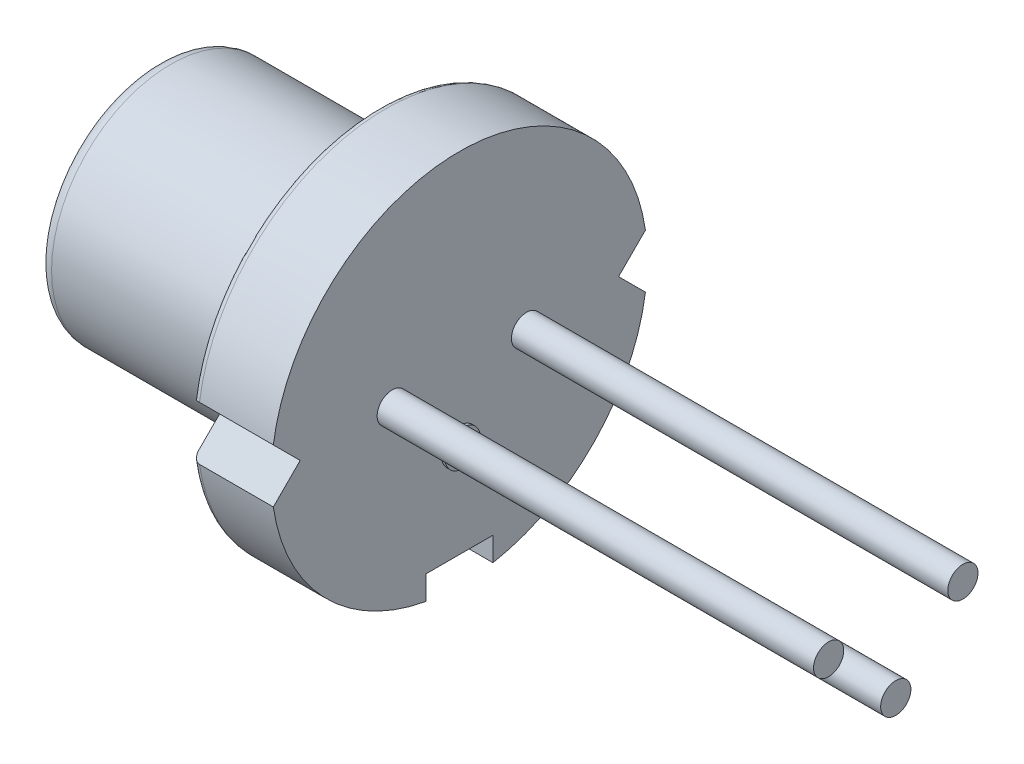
ISO-10303-21;
HEADER;
FILE_DESCRIPTION(('STEP AP214'),'2;1');
FILE_NAME('part.step','',(''),(''),'','','');
FILE_SCHEMA(('AUTOMOTIVE_DESIGN { 1 0 10303 214 1 1 1 1 }'));
ENDSEC;
DATA;
#1=APPLICATION_CONTEXT('core data for automotive mechanical design processes');
#2=APPLICATION_PROTOCOL_DEFINITION('international standard','automotive_design',2000,#1);
#3=PRODUCT_CONTEXT('',#1,'mechanical');
#4=PRODUCT('Part','Part','',(#3));
#5=PRODUCT_RELATED_PRODUCT_CATEGORY('part','',(#4));
#6=PRODUCT_DEFINITION_FORMATION('','',#4);
#7=PRODUCT_DEFINITION_CONTEXT('part definition',#1,'design');
#8=PRODUCT_DEFINITION('design','',#6,#7);
#9=PRODUCT_DEFINITION_SHAPE('','',#8);
#10=(LENGTH_UNIT() NAMED_UNIT(*) SI_UNIT(.MILLI.,.METRE.));
#11=(NAMED_UNIT(*) PLANE_ANGLE_UNIT() SI_UNIT($,.RADIAN.));
#12=(NAMED_UNIT(*) SI_UNIT($,.STERADIAN.) SOLID_ANGLE_UNIT());
#13=UNCERTAINTY_MEASURE_WITH_UNIT(LENGTH_MEASURE(1.E-05),#10,'distance_accuracy_value','');
#14=(GEOMETRIC_REPRESENTATION_CONTEXT(3) GLOBAL_UNCERTAINTY_ASSIGNED_CONTEXT((#13)) GLOBAL_UNIT_ASSIGNED_CONTEXT((#10,
#11,#12)) REPRESENTATION_CONTEXT('',''));
#15=CARTESIAN_POINT('',(0.,0.,0.));
#16=DIRECTION('',(0.,0.,1.));
#17=DIRECTION('',(1.,0.,0.));
#18=AXIS2_PLACEMENT_3D('',#15,#16,#17);
#19=CARTESIAN_POINT('',(3.47,0.,0.));
#20=DIRECTION('',(-1.,0.,0.));
#21=DIRECTION('',(0.,0.,1.));
#22=AXIS2_PLACEMENT_3D('',#19,#20,#21);
#23=PLANE('',#22);
#24=DIRECTION('',(0.,1.,0.));
#25=VECTOR('',#24,1.);
#26=CARTESIAN_POINT('',(3.47,0.,0.5));
#27=LINE('',#26,#25);
#28=CARTESIAN_POINT('',(3.47,-2.75499546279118,0.5));
#29=VERTEX_POINT('',#28);
#30=CARTESIAN_POINT('',(3.47,-2.4,0.5));
#31=VERTEX_POINT('',#30);
#32=EDGE_CURVE('E134',#29,#31,#27,.T.);
#33=ORIENTED_EDGE('',*,*,#32,.T.);
#34=DIRECTION('',(0.,0.,1.));
#35=VECTOR('',#34,1.);
#36=CARTESIAN_POINT('',(3.47,-2.4,0.));
#37=LINE('',#36,#35);
#38=CARTESIAN_POINT('',(3.47,-2.4,-0.5));
#39=VERTEX_POINT('',#38);
#40=EDGE_CURVE('E415',#39,#31,#37,.T.);
#41=ORIENTED_EDGE('',*,*,#40,.F.);
#42=DIRECTION('',(0.,1.,0.));
#43=VECTOR('',#42,1.);
#44=CARTESIAN_POINT('',(3.47,0.,-0.5));
#45=LINE('',#44,#43);
#46=CARTESIAN_POINT('',(3.47,-2.75499546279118,-0.5));
#47=VERTEX_POINT('',#46);
#48=EDGE_CURVE('E145',#47,#39,#45,.T.);
#49=ORIENTED_EDGE('',*,*,#48,.F.);
#50=CARTESIAN_POINT('',(3.47,0.,0.));
#51=DIRECTION('',(-1.,0.,0.));
#52=DIRECTION('',(0.,0.,1.));
#53=AXIS2_PLACEMENT_3D('',#50,#51,#52);
#54=CIRCLE('',#53,2.8);
#55=CARTESIAN_POINT('',(3.47,-0.4,-2.7712812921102));
#56=VERTEX_POINT('',#55);
#57=EDGE_CURVE('E163',#56,#47,#54,.T.);
#58=ORIENTED_EDGE('',*,*,#57,.F.);
#59=DIRECTION('',(0.,-0.707106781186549,-0.707106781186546));
#60=VECTOR('',#59,1.);
#61=CARTESIAN_POINT('',(3.47,1.1856406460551,-1.18564064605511));
#62=LINE('',#61,#60);
#63=CARTESIAN_POINT('',(3.47,0.,-2.3712812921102));
#64=VERTEX_POINT('',#63);
#65=EDGE_CURVE('E403',#64,#56,#62,.T.);
#66=ORIENTED_EDGE('',*,*,#65,.F.);
#67=DIRECTION('',(0.,0.707106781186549,-0.707106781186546));
#68=VECTOR('',#67,1.);
#69=CARTESIAN_POINT('',(3.47,-1.1856406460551,-1.18564064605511));
#70=LINE('',#69,#68);
#71=CARTESIAN_POINT('',(3.47,0.400000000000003,-2.7712812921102));
#72=VERTEX_POINT('',#71);
#73=EDGE_CURVE('E406',#64,#72,#70,.T.);
#74=ORIENTED_EDGE('',*,*,#73,.T.);
#75=CARTESIAN_POINT('',(3.47,0.400000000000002,2.7712812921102));
#76=VERTEX_POINT('',#75);
#77=EDGE_CURVE('E166',#76,#72,#54,.T.);
#78=ORIENTED_EDGE('',*,*,#77,.F.);
#79=DIRECTION('',(0.,0.707106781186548,0.707106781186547));
#80=VECTOR('',#79,1.);
#81=CARTESIAN_POINT('',(3.47,-1.1856406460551,1.1856406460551));
#82=LINE('',#81,#80);
#83=CARTESIAN_POINT('',(3.47,0.,2.3712812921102));
#84=VERTEX_POINT('',#83);
#85=EDGE_CURVE('E392',#84,#76,#82,.T.);
#86=ORIENTED_EDGE('',*,*,#85,.F.);
#87=DIRECTION('',(0.,-0.707106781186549,0.707106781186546));
#88=VECTOR('',#87,1.);
#89=CARTESIAN_POINT('',(3.47,1.1856406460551,1.18564064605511));
#90=LINE('',#89,#88);
#91=CARTESIAN_POINT('',(3.47,-0.400000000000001,2.7712812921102));
#92=VERTEX_POINT('',#91);
#93=EDGE_CURVE('E162',#84,#92,#90,.T.);
#94=ORIENTED_EDGE('',*,*,#93,.T.);
#95=EDGE_CURVE('E152',#29,#92,#54,.T.);
#96=ORIENTED_EDGE('',*,*,#95,.F.);
#97=EDGE_LOOP('',(#33,#41,#49,#58,#66,#74,#78,#86,#94,#96));
#98=FACE_BOUND('',#97,.T.);
#99=CARTESIAN_POINT('',(3.47,0.,1.));
#100=DIRECTION('',(-1.,0.,0.));
#101=DIRECTION('',(0.,0.,1.));
#102=AXIS2_PLACEMENT_3D('',#99,#100,#101);
#103=CIRCLE('',#102,0.225);
#104=CARTESIAN_POINT('',(3.47,0.,1.225));
#105=VERTEX_POINT('',#104);
#106=EDGE_CURVE('E188',#105,#105,#103,.F.);
#107=ORIENTED_EDGE('',*,*,#106,.F.);
#108=EDGE_LOOP('',(#107));
#109=FACE_BOUND('',#108,.T.);
#110=CARTESIAN_POINT('',(3.47,0.,-1.));
#111=DIRECTION('',(-1.,0.,0.));
#112=DIRECTION('',(0.,0.,1.));
#113=AXIS2_PLACEMENT_3D('',#110,#111,#112);
#114=CIRCLE('',#113,0.225);
#115=CARTESIAN_POINT('',(3.47,0.,-0.775));
#116=VERTEX_POINT('',#115);
#117=EDGE_CURVE('E191',#116,#116,#114,.F.);
#118=ORIENTED_EDGE('',*,*,#117,.F.);
#119=EDGE_LOOP('',(#118));
#120=FACE_BOUND('',#119,.T.);
#121=CARTESIAN_POINT('',(3.47,-1.,0.));
#122=DIRECTION('',(-1.,0.,0.));
#123=DIRECTION('',(0.,0.,1.));
#124=AXIS2_PLACEMENT_3D('',#121,#122,#123);
#125=CIRCLE('',#124,0.265);
#126=CARTESIAN_POINT('',(3.47,-1.,0.265));
#127=VERTEX_POINT('',#126);
#128=EDGE_CURVE('E11',#127,#127,#125,.F.);
#129=ORIENTED_EDGE('',*,*,#128,.F.);
#130=EDGE_LOOP('',(#129));
#131=FACE_BOUND('',#130,.T.);
#132=ADVANCED_FACE('F37',(#98,#109,#120,#131),#23,.F.);
#133=CARTESIAN_POINT('',(2.27,2.8,0.));
#134=DIRECTION('',(1.,0.,0.));
#135=DIRECTION('',(0.,0.,-1.));
#136=AXIS2_PLACEMENT_3D('',#133,#134,#135);
#137=PLANE('',#136);
#138=CARTESIAN_POINT('',(2.27,0.,0.));
#139=DIRECTION('',(-1.,0.,0.));
#140=DIRECTION('',(0.,0.,1.));
#141=AXIS2_PLACEMENT_3D('',#138,#139,#140);
#142=CIRCLE('',#141,2.05);
#143=CARTESIAN_POINT('',(2.27,0.,2.05));
#144=VERTEX_POINT('',#143);
#145=EDGE_CURVE('E173',#144,#144,#142,.T.);
#146=ORIENTED_EDGE('',*,*,#145,.F.);
#147=EDGE_LOOP('',(#146));
#148=FACE_BOUND('',#147,.T.);
#149=DIRECTION('',(0.,-0.707106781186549,-0.707106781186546));
#150=VECTOR('',#149,1.);
#151=CARTESIAN_POINT('',(2.27,2.58564064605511,0.214359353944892));
#152=LINE('',#151,#150);
#153=CARTESIAN_POINT('',(2.27,0.,-2.3712812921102));
#154=VERTEX_POINT('',#153);
#155=CARTESIAN_POINT('',(2.27,-0.310773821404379,-2.68205511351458));
#156=VERTEX_POINT('',#155);
#157=EDGE_CURVE('E398',#154,#156,#152,.T.);
#158=ORIENTED_EDGE('',*,*,#157,.T.);
#159=CARTESIAN_POINT('',(2.27,0.,0.));
#160=DIRECTION('',(1.,0.,0.));
#161=DIRECTION('',(0.,0.,-1.));
#162=AXIS2_PLACEMENT_3D('',#159,#160,#161);
#163=CIRCLE('',#162,2.7);
#164=CARTESIAN_POINT('',(2.27,-2.65329983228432,-0.5));
#165=VERTEX_POINT('',#164);
#166=EDGE_CURVE('E218',#156,#165,#163,.F.);
#167=ORIENTED_EDGE('',*,*,#166,.T.);
#168=DIRECTION('',(0.,1.,0.));
#169=VECTOR('',#168,1.);
#170=CARTESIAN_POINT('',(2.27,2.8,-0.5));
#171=LINE('',#170,#169);
#172=CARTESIAN_POINT('',(2.27,-2.4,-0.5));
#173=VERTEX_POINT('',#172);
#174=EDGE_CURVE('E411',#165,#173,#171,.T.);
#175=ORIENTED_EDGE('',*,*,#174,.T.);
#176=DIRECTION('',(0.,0.,1.));
#177=VECTOR('',#176,1.);
#178=CARTESIAN_POINT('',(2.27,-2.4,0.));
#179=LINE('',#178,#177);
#180=CARTESIAN_POINT('',(2.27,-2.4,0.5));
#181=VERTEX_POINT('',#180);
#182=EDGE_CURVE('E156',#173,#181,#179,.T.);
#183=ORIENTED_EDGE('',*,*,#182,.T.);
#184=DIRECTION('',(0.,1.,0.));
#185=VECTOR('',#184,1.);
#186=CARTESIAN_POINT('',(2.27,2.8,0.5));
#187=LINE('',#186,#185);
#188=CARTESIAN_POINT('',(2.27,-2.65329983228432,0.5));
#189=VERTEX_POINT('',#188);
#190=EDGE_CURVE('E409',#189,#181,#187,.T.);
#191=ORIENTED_EDGE('',*,*,#190,.F.);
#192=CARTESIAN_POINT('',(2.27,0.,0.));
#193=DIRECTION('',(1.,0.,0.));
#194=DIRECTION('',(0.,0.,-1.));
#195=AXIS2_PLACEMENT_3D('',#192,#193,#194);
#196=CIRCLE('',#195,2.7);
#197=CARTESIAN_POINT('',(2.27,-0.31077382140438,2.68205511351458));
#198=VERTEX_POINT('',#197);
#199=EDGE_CURVE('E215',#189,#198,#196,.F.);
#200=ORIENTED_EDGE('',*,*,#199,.T.);
#201=DIRECTION('',(0.,-0.707106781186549,0.707106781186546));
#202=VECTOR('',#201,1.);
#203=CARTESIAN_POINT('',(2.27,2.58564064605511,-0.214359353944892));
#204=LINE('',#203,#202);
#205=CARTESIAN_POINT('',(2.27,0.,2.3712812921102));
#206=VERTEX_POINT('',#205);
#207=EDGE_CURVE('E384',#206,#198,#204,.T.);
#208=ORIENTED_EDGE('',*,*,#207,.F.);
#209=DIRECTION('',(0.,0.707106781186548,0.707106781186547));
#210=VECTOR('',#209,1.);
#211=CARTESIAN_POINT('',(2.27,0.214359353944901,2.5856406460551));
#212=LINE('',#211,#210);
#213=CARTESIAN_POINT('',(2.27,0.310773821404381,2.68205511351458));
#214=VERTEX_POINT('',#213);
#215=EDGE_CURVE('E387',#206,#214,#212,.T.);
#216=ORIENTED_EDGE('',*,*,#215,.T.);
#217=CARTESIAN_POINT('',(2.27,0.,0.));
#218=DIRECTION('',(1.,0.,0.));
#219=DIRECTION('',(0.,0.,-1.));
#220=AXIS2_PLACEMENT_3D('',#217,#218,#219);
#221=CIRCLE('',#220,2.7);
#222=CARTESIAN_POINT('',(2.27,0.310773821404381,-2.68205511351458));
#223=VERTEX_POINT('',#222);
#224=EDGE_CURVE('E212',#214,#223,#221,.F.);
#225=ORIENTED_EDGE('',*,*,#224,.T.);
#226=DIRECTION('',(0.,0.707106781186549,-0.707106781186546));
#227=VECTOR('',#226,1.);
#228=CARTESIAN_POINT('',(2.27,0.214359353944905,-2.58564064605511));
#229=LINE('',#228,#227);
#230=EDGE_CURVE('E396',#154,#223,#229,.T.);
#231=ORIENTED_EDGE('',*,*,#230,.F.);
#232=EDGE_LOOP('',(#158,#167,#175,#183,#191,#200,#208,#216,#225,#231));
#233=FACE_BOUND('',#232,.T.);
#234=ADVANCED_FACE('F329',(#148,#233),#137,.F.);
#235=CARTESIAN_POINT('',(-2.49171245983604,0.,0.));
#236=DIRECTION('',(-1.,0.,0.));
#237=DIRECTION('',(0.,0.,1.));
#238=AXIS2_PLACEMENT_3D('',#235,#236,#237);
#239=CYLINDRICAL_SURFACE('',#238,2.8);
#240=DIRECTION('',(-1.,0.,0.));
#241=VECTOR('',#240,1.);
#242=CARTESIAN_POINT('',(-2.49171245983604,-0.400000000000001,2.7712812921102));
#243=LINE('',#242,#241);
#244=CARTESIAN_POINT('',(2.37,-0.400000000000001,2.7712812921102));
#245=VERTEX_POINT('',#244);
#246=EDGE_CURVE('E196',#245,#92,#243,.F.);
#247=ORIENTED_EDGE('',*,*,#246,.F.);
#248=CARTESIAN_POINT('',(2.37,0.,0.));
#249=DIRECTION('',(1.,0.,0.));
#250=DIRECTION('',(0.,0.,-1.));
#251=AXIS2_PLACEMENT_3D('',#248,#249,#250);
#252=CIRCLE('',#251,2.8);
#253=CARTESIAN_POINT('',(2.37,-2.75499546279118,0.5));
#254=VERTEX_POINT('',#253);
#255=EDGE_CURVE('E155',#245,#254,#252,.T.);
#256=ORIENTED_EDGE('',*,*,#255,.T.);
#257=DIRECTION('',(-1.,0.,0.));
#258=VECTOR('',#257,1.);
#259=CARTESIAN_POINT('',(-2.49171245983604,-2.75499546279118,0.5));
#260=LINE('',#259,#258);
#261=EDGE_CURVE('E137',#29,#254,#260,.T.);
#262=ORIENTED_EDGE('',*,*,#261,.F.);
#263=ORIENTED_EDGE('',*,*,#95,.T.);
#264=EDGE_LOOP('',(#247,#256,#262,#263));
#265=FACE_BOUND('',#264,.T.);
#266=ADVANCED_FACE('F151',(#265),#239,.T.);
#267=DIRECTION('',(-1.,0.,0.));
#268=VECTOR('',#267,1.);
#269=CARTESIAN_POINT('',(-2.49171245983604,0.400000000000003,-2.7712812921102));
#270=LINE('',#269,#268);
#271=CARTESIAN_POINT('',(2.37,0.400000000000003,-2.7712812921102));
#272=VERTEX_POINT('',#271);
#273=EDGE_CURVE('E200',#272,#72,#270,.F.);
#274=ORIENTED_EDGE('',*,*,#273,.F.);
#275=CARTESIAN_POINT('',(2.37,0.,0.));
#276=DIRECTION('',(1.,0.,0.));
#277=DIRECTION('',(0.,0.,-1.));
#278=AXIS2_PLACEMENT_3D('',#275,#276,#277);
#279=CIRCLE('',#278,2.8);
#280=CARTESIAN_POINT('',(2.37,0.400000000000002,2.7712812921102));
#281=VERTEX_POINT('',#280);
#282=EDGE_CURVE('E54',#272,#281,#279,.T.);
#283=ORIENTED_EDGE('',*,*,#282,.T.);
#284=DIRECTION('',(-1.,0.,0.));
#285=VECTOR('',#284,1.);
#286=CARTESIAN_POINT('',(-2.49171245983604,0.400000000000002,2.7712812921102));
#287=LINE('',#286,#285);
#288=EDGE_CURVE('E194',#281,#76,#287,.F.);
#289=ORIENTED_EDGE('',*,*,#288,.T.);
#290=ORIENTED_EDGE('',*,*,#77,.T.);
#291=EDGE_LOOP('',(#274,#283,#289,#290));
#292=FACE_BOUND('',#291,.T.);
#293=ADVANCED_FACE('F334',(#292),#239,.T.);
#294=DIRECTION('',(-1.,0.,0.));
#295=VECTOR('',#294,1.);
#296=CARTESIAN_POINT('',(-2.49171245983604,-2.75499546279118,-0.5));
#297=LINE('',#296,#295);
#298=CARTESIAN_POINT('',(2.37,-2.75499546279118,-0.5));
#299=VERTEX_POINT('',#298);
#300=EDGE_CURVE('E157',#47,#299,#297,.T.);
#301=ORIENTED_EDGE('',*,*,#300,.T.);
#302=CARTESIAN_POINT('',(2.37,0.,0.));
#303=DIRECTION('',(1.,0.,0.));
#304=DIRECTION('',(0.,0.,-1.));
#305=AXIS2_PLACEMENT_3D('',#302,#303,#304);
#306=CIRCLE('',#305,2.8);
#307=CARTESIAN_POINT('',(2.37,-0.4,-2.7712812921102));
#308=VERTEX_POINT('',#307);
#309=EDGE_CURVE('E229',#299,#308,#306,.T.);
#310=ORIENTED_EDGE('',*,*,#309,.T.);
#311=DIRECTION('',(-1.,0.,0.));
#312=VECTOR('',#311,1.);
#313=CARTESIAN_POINT('',(-2.49171245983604,-0.4,-2.7712812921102));
#314=LINE('',#313,#312);
#315=EDGE_CURVE('E198',#308,#56,#314,.F.);
#316=ORIENTED_EDGE('',*,*,#315,.T.);
#317=ORIENTED_EDGE('',*,*,#57,.T.);
#318=EDGE_LOOP('',(#301,#310,#316,#317));
#319=FACE_BOUND('',#318,.T.);
#320=ADVANCED_FACE('F330',(#319),#239,.T.);
#321=CARTESIAN_POINT('',(-1.03,0.8,0.));
#322=DIRECTION('',(1.,0.,0.));
#323=DIRECTION('',(0.,0.,-1.));
#324=AXIS2_PLACEMENT_3D('',#321,#322,#323);
#325=PLANE('',#324);
#326=CARTESIAN_POINT('',(-1.03,0.,0.));
#327=DIRECTION('',(1.,0.,0.));
#328=DIRECTION('',(0.,0.,-1.));
#329=AXIS2_PLACEMENT_3D('',#326,#327,#328);
#330=CIRCLE('',#329,1.575);
#331=CARTESIAN_POINT('',(-1.03,0.,-1.575));
#332=VERTEX_POINT('',#331);
#333=EDGE_CURVE('E206',#332,#332,#330,.F.);
#334=ORIENTED_EDGE('',*,*,#333,.T.);
#335=EDGE_LOOP('',(#334));
#336=FACE_BOUND('',#335,.T.);
#337=CARTESIAN_POINT('',(-1.03,0.,0.));
#338=DIRECTION('',(-1.,0.,0.));
#339=DIRECTION('',(0.,0.,1.));
#340=AXIS2_PLACEMENT_3D('',#337,#338,#339);
#341=CIRCLE('',#340,0.8);
#342=CARTESIAN_POINT('',(-1.03,0.,0.8));
#343=VERTEX_POINT('',#342);
#344=EDGE_CURVE('E169',#343,#343,#341,.T.);
#345=ORIENTED_EDGE('',*,*,#344,.F.);
#346=EDGE_LOOP('',(#345));
#347=FACE_BOUND('',#346,.T.);
#348=ADVANCED_FACE('F333',(#336,#347),#325,.F.);
#349=CARTESIAN_POINT('',(-2.49171245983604,0.,0.));
#350=DIRECTION('',(-1.,0.,0.));
#351=DIRECTION('',(0.,0.,1.));
#352=AXIS2_PLACEMENT_3D('',#349,#350,#351);
#353=CYLINDRICAL_SURFACE('',#352,1.775);
#354=CARTESIAN_POINT('',(-0.830000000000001,0.,0.));
#355=DIRECTION('',(1.,0.,0.));
#356=DIRECTION('',(0.,0.,-1.));
#357=AXIS2_PLACEMENT_3D('',#354,#355,#356);
#358=CIRCLE('',#357,1.775);
#359=CARTESIAN_POINT('',(-0.830000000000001,0.,-1.775));
#360=VERTEX_POINT('',#359);
#361=EDGE_CURVE('E209',#360,#360,#358,.T.);
#362=ORIENTED_EDGE('',*,*,#361,.T.);
#363=EDGE_LOOP('',(#362));
#364=FACE_BOUND('',#363,.T.);
#365=CARTESIAN_POINT('',(1.72,0.,0.));
#366=DIRECTION('',(-1.,0.,0.));
#367=DIRECTION('',(0.,0.,1.));
#368=AXIS2_PLACEMENT_3D('',#365,#366,#367);
#369=CIRCLE('',#368,1.775);
#370=CARTESIAN_POINT('',(1.72,0.,1.775));
#371=VERTEX_POINT('',#370);
#372=EDGE_CURVE('E185',#371,#371,#369,.T.);
#373=ORIENTED_EDGE('',*,*,#372,.T.);
#374=EDGE_LOOP('',(#373));
#375=FACE_BOUND('',#374,.T.);
#376=ADVANCED_FACE('F349',(#364,#375),#353,.T.);
#377=CARTESIAN_POINT('',(1.72,0.,0.));
#378=DIRECTION('',(-1.,0.,0.));
#379=DIRECTION('',(0.,0.,1.));
#380=AXIS2_PLACEMENT_3D('',#377,#378,#379);
#381=TOROIDAL_SURFACE('',#380,2.025,0.25);
#382=ORIENTED_EDGE('',*,*,#372,.F.);
#383=EDGE_LOOP('',(#382));
#384=FACE_BOUND('',#383,.T.);
#385=CARTESIAN_POINT('',(1.97,0.,0.));
#386=DIRECTION('',(-1.,0.,0.));
#387=DIRECTION('',(0.,0.,1.));
#388=AXIS2_PLACEMENT_3D('',#385,#386,#387);
#389=CIRCLE('',#388,2.025);
#390=CARTESIAN_POINT('',(1.97,0.,2.025));
#391=VERTEX_POINT('',#390);
#392=EDGE_CURVE('E180',#391,#391,#389,.T.);
#393=ORIENTED_EDGE('',*,*,#392,.T.);
#394=EDGE_LOOP('',(#393));
#395=FACE_BOUND('',#394,.T.);
#396=ADVANCED_FACE('F345',(#384,#395),#381,.F.);
#397=CARTESIAN_POINT('',(1.97,2.05,0.));
#398=DIRECTION('',(1.,0.,0.));
#399=DIRECTION('',(0.,0.,-1.));
#400=AXIS2_PLACEMENT_3D('',#397,#398,#399);
#401=PLANE('',#400);
#402=ORIENTED_EDGE('',*,*,#392,.F.);
#403=EDGE_LOOP('',(#402));
#404=FACE_BOUND('',#403,.T.);
#405=CARTESIAN_POINT('',(1.97,0.,0.));
#406=DIRECTION('',(-1.,0.,0.));
#407=DIRECTION('',(0.,0.,1.));
#408=AXIS2_PLACEMENT_3D('',#405,#406,#407);
#409=CIRCLE('',#408,2.05);
#410=CARTESIAN_POINT('',(1.97,0.,2.05));
#411=VERTEX_POINT('',#410);
#412=EDGE_CURVE('E176',#411,#411,#409,.T.);
#413=ORIENTED_EDGE('',*,*,#412,.T.);
#414=EDGE_LOOP('',(#413));
#415=FACE_BOUND('',#414,.T.);
#416=ADVANCED_FACE('F341',(#404,#415),#401,.F.);
#417=CARTESIAN_POINT('',(-2.49171245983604,0.,0.));
#418=DIRECTION('',(-1.,0.,0.));
#419=DIRECTION('',(0.,0.,1.));
#420=AXIS2_PLACEMENT_3D('',#417,#418,#419);
#421=CYLINDRICAL_SURFACE('',#420,2.05);
#422=ORIENTED_EDGE('',*,*,#412,.F.);
#423=EDGE_LOOP('',(#422));
#424=FACE_BOUND('',#423,.T.);
#425=ORIENTED_EDGE('',*,*,#145,.T.);
#426=EDGE_LOOP('',(#425));
#427=FACE_BOUND('',#426,.T.);
#428=ADVANCED_FACE('F315',(#424,#427),#421,.T.);
#429=CARTESIAN_POINT('',(-2.49171245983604,0.,0.));
#430=DIRECTION('',(-1.,0.,0.));
#431=DIRECTION('',(0.,0.,1.));
#432=AXIS2_PLACEMENT_3D('',#429,#430,#431);
#433=CYLINDRICAL_SURFACE('',#432,0.8);
#434=CARTESIAN_POINT('',(-0.980000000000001,0.,0.));
#435=DIRECTION('',(-1.,0.,0.));
#436=DIRECTION('',(0.,0.,1.));
#437=AXIS2_PLACEMENT_3D('',#434,#435,#436);
#438=CIRCLE('',#437,0.8);
#439=CARTESIAN_POINT('',(-0.980000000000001,0.,0.8));
#440=VERTEX_POINT('',#439);
#441=EDGE_CURVE('E422',#440,#440,#438,.T.);
#442=ORIENTED_EDGE('',*,*,#441,.F.);
#443=EDGE_LOOP('',(#442));
#444=FACE_BOUND('',#443,.T.);
#445=ORIENTED_EDGE('',*,*,#344,.T.);
#446=EDGE_LOOP('',(#445));
#447=FACE_BOUND('',#446,.T.);
#448=ADVANCED_FACE('F302',(#444,#447),#433,.F.);
#449=CARTESIAN_POINT('',(9.97,0.,1.));
#450=DIRECTION('',(-1.,0.,0.));
#451=DIRECTION('',(0.,0.,1.));
#452=AXIS2_PLACEMENT_3D('',#449,#450,#451);
#453=CYLINDRICAL_SURFACE('',#452,0.225);
#454=CARTESIAN_POINT('',(9.97,0.,1.));
#455=DIRECTION('',(1.,0.,0.));
#456=DIRECTION('',(0.,0.,-1.));
#457=AXIS2_PLACEMENT_3D('',#454,#455,#456);
#458=CIRCLE('',#457,0.225);
#459=CARTESIAN_POINT('',(9.97,0.,0.775));
#460=VERTEX_POINT('',#459);
#461=EDGE_CURVE('E376',#460,#460,#458,.T.);
#462=ORIENTED_EDGE('',*,*,#461,.F.);
#463=EDGE_LOOP('',(#462));
#464=FACE_BOUND('',#463,.T.);
#465=ORIENTED_EDGE('',*,*,#106,.T.);
#466=EDGE_LOOP('',(#465));
#467=FACE_BOUND('',#466,.T.);
#468=ADVANCED_FACE('F298',(#464,#467),#453,.T.);
#469=CARTESIAN_POINT('',(9.97,0.,0.));
#470=DIRECTION('',(1.,0.,0.));
#471=DIRECTION('',(0.,0.,-1.));
#472=AXIS2_PLACEMENT_3D('',#469,#470,#471);
#473=PLANE('',#472);
#474=ORIENTED_EDGE('',*,*,#461,.T.);
#475=EDGE_LOOP('',(#474));
#476=FACE_BOUND('',#475,.T.);
#477=ADVANCED_FACE('F294',(#476),#473,.T.);
#478=CARTESIAN_POINT('',(9.97,0.,-1.));
#479=DIRECTION('',(-1.,0.,0.));
#480=DIRECTION('',(0.,0.,1.));
#481=AXIS2_PLACEMENT_3D('',#478,#479,#480);
#482=CYLINDRICAL_SURFACE('',#481,0.225);
#483=CARTESIAN_POINT('',(9.97,0.,-1.));
#484=DIRECTION('',(1.,0.,0.));
#485=DIRECTION('',(0.,0.,-1.));
#486=AXIS2_PLACEMENT_3D('',#483,#484,#485);
#487=CIRCLE('',#486,0.225);
#488=CARTESIAN_POINT('',(9.97,0.,-1.225));
#489=VERTEX_POINT('',#488);
#490=EDGE_CURVE('E381',#489,#489,#487,.T.);
#491=ORIENTED_EDGE('',*,*,#490,.F.);
#492=EDGE_LOOP('',(#491));
#493=FACE_BOUND('',#492,.T.);
#494=ORIENTED_EDGE('',*,*,#117,.T.);
#495=EDGE_LOOP('',(#494));
#496=FACE_BOUND('',#495,.T.);
#497=ADVANCED_FACE('F290',(#493,#496),#482,.T.);
#498=CARTESIAN_POINT('',(9.97,0.,0.));
#499=DIRECTION('',(1.,0.,0.));
#500=DIRECTION('',(0.,0.,-1.));
#501=AXIS2_PLACEMENT_3D('',#498,#499,#500);
#502=PLANE('',#501);
#503=ORIENTED_EDGE('',*,*,#490,.T.);
#504=EDGE_LOOP('',(#503));
#505=FACE_BOUND('',#504,.T.);
#506=ADVANCED_FACE('F285',(#505),#502,.T.);
#507=CARTESIAN_POINT('',(-1.03,1.1856406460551,1.18564064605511));
#508=DIRECTION('',(0.,0.707106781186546,0.707106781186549));
#509=DIRECTION('',(0.,-0.707106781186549,0.707106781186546));
#510=AXIS2_PLACEMENT_3D('',#507,#508,#509);
#511=PLANE('',#510);
#512=ORIENTED_EDGE('',*,*,#207,.T.);
#513=CARTESIAN_POINT('',(2.27,-0.310773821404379,2.68205511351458));
#514=CARTESIAN_POINT('',(2.27000279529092,-0.316742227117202,2.6880235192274));
#515=CARTESIAN_POINT('',(2.27065738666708,-0.322722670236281,2.69400396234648));
#516=CARTESIAN_POINT('',(2.27332459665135,-0.334568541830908,2.70584983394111));
#517=CARTESIAN_POINT('',(2.27534602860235,-0.340432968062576,2.71171426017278));
#518=CARTESIAN_POINT('',(2.28037417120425,-0.350930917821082,2.72221220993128));
#519=CARTESIAN_POINT('',(2.28317632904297,-0.355613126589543,2.72689441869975));
#520=CARTESIAN_POINT('',(2.28981350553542,-0.364588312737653,2.73586960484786));
#521=CARTESIAN_POINT('',(2.29364577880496,-0.368882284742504,2.74016357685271));
#522=CARTESIAN_POINT('',(2.30150308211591,-0.376125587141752,2.74740687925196));
#523=CARTESIAN_POINT('',(2.30534526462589,-0.379173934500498,2.7504552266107));
#524=CARTESIAN_POINT('',(2.31368423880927,-0.384788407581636,2.75606969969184));
#525=CARTESIAN_POINT('',(2.318180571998,-0.387354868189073,2.75863616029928));
#526=CARTESIAN_POINT('',(2.32704364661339,-0.391535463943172,2.76281675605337));
#527=CARTESIAN_POINT('',(2.33133020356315,-0.39323446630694,2.76451575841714));
#528=CARTESIAN_POINT('',(2.34024204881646,-0.396102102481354,2.76738339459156));
#529=CARTESIAN_POINT('',(2.34486677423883,-0.397271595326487,2.76855288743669));
#530=CARTESIAN_POINT('',(2.35292395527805,-0.398754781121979,2.77003607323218));
#531=CARTESIAN_POINT('',(2.35630190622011,-0.399219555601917,2.77050084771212));
#532=CARTESIAN_POINT('',(2.36311894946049,-0.399843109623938,2.77112440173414));
#533=CARTESIAN_POINT('',(2.36655812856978,-0.400001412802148,2.77128270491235));
#534=CARTESIAN_POINT('',(2.36999999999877,-0.400000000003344,2.77128129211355));
#535=B_SPLINE_CURVE_WITH_KNOTS('',3,(#513,#514,#515,#516,#517,#518,#519,#520,#521,#522,#523,
#524,#525,#526,#527,#528,#529,#530,#531,#532,#533,#534),.UNSPECIFIED.,.F.,.F.,(4,2,2,2,2,2,2,2,
2,2,4),(0.,0.0253253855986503,0.0508156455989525,0.0723033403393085,0.0937343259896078,
0.110992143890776,0.128237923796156,0.142918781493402,0.157575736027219,0.167873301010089,
0.178186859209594),.UNSPECIFIED.);
#536=EDGE_CURVE('E268',#198,#245,#535,.T.);
#537=ORIENTED_EDGE('',*,*,#536,.T.);
#538=ORIENTED_EDGE('',*,*,#246,.T.);
#539=ORIENTED_EDGE('',*,*,#93,.F.);
#540=DIRECTION('',(1.,0.,0.));
#541=VECTOR('',#540,1.);
#542=CARTESIAN_POINT('',(-1.03,0.,2.3712812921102));
#543=LINE('',#542,#541);
#544=EDGE_CURVE('E390',#206,#84,#543,.T.);
#545=ORIENTED_EDGE('',*,*,#544,.F.);
#546=EDGE_LOOP('',(#512,#537,#538,#539,#545));
#547=FACE_BOUND('',#546,.T.);
#548=ADVANCED_FACE('F279',(#547),#511,.T.);
#549=CARTESIAN_POINT('',(-1.03,-1.1856406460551,1.1856406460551));
#550=DIRECTION('',(0.,0.707106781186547,-0.707106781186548));
#551=DIRECTION('',(0.,0.707106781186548,0.707106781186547));
#552=AXIS2_PLACEMENT_3D('',#549,#550,#551);
#553=PLANE('',#552);
#554=ORIENTED_EDGE('',*,*,#288,.F.);
#555=CARTESIAN_POINT('',(2.37,0.400000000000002,2.7712812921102));
#556=CARTESIAN_POINT('',(2.36517210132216,0.400006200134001,2.7712874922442));
#557=CARTESIAN_POINT('',(2.36035184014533,0.399691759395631,2.77097305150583));
#558=CARTESIAN_POINT('',(2.35089061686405,0.398473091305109,2.76975438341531));
#559=CARTESIAN_POINT('',(2.34624877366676,0.397572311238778,2.76885360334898));
#560=CARTESIAN_POINT('',(2.33725565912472,0.395233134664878,2.76651442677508));
#561=CARTESIAN_POINT('',(2.33290396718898,0.393795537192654,2.76507682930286));
#562=CARTESIAN_POINT('',(2.32456944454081,0.390456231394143,2.76173752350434));
#563=CARTESIAN_POINT('',(2.32058708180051,0.388553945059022,2.75983523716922));
#564=CARTESIAN_POINT('',(2.31279627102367,0.384221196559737,2.75550248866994));
#565=CARTESIAN_POINT('',(2.30901824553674,0.381763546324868,2.75304483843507));
#566=CARTESIAN_POINT('',(2.30198781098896,0.376499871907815,2.74778116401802));
#567=CARTESIAN_POINT('',(2.29873554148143,0.373693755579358,2.74497504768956));
#568=CARTESIAN_POINT('',(2.29220147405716,0.367255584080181,2.73853687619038));
#569=CARTESIAN_POINT('',(2.28903004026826,0.363567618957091,2.73484891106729));
#570=CARTESIAN_POINT('',(2.28343330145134,0.35591791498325,2.72719920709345));
#571=CARTESIAN_POINT('',(2.28100876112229,0.351955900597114,2.72323719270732));
#572=CARTESIAN_POINT('',(2.27645876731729,0.343000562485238,2.71428185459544));
#573=CARTESIAN_POINT('',(2.27450134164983,0.337964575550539,2.70924586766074));
#574=CARTESIAN_POINT('',(2.27161901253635,0.327753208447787,2.69903450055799));
#575=CARTESIAN_POINT('',(2.2706931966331,0.322577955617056,2.69385924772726));
#576=CARTESIAN_POINT('',(2.27008961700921,0.315183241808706,2.68646453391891));
#577=CARTESIAN_POINT('',(2.27000015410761,0.312978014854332,2.68425930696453));
#578=CARTESIAN_POINT('',(2.27,0.310773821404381,2.68205511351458));
#579=B_SPLINE_CURVE_WITH_KNOTS('',3,(#555,#556,#557,#558,#559,#560,#561,#562,#563,#564,#565,
#566,#567,#568,#569,#570,#571,#572,#573,#574,#575,#576,#577,#578),.UNSPECIFIED.,.F.,.F.,(4,2,2,
2,2,2,2,2,2,2,2,4),(0.,0.0144512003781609,0.0288181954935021,0.0431638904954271,
0.0575275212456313,0.0728715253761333,0.0882195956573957,0.106465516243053,0.124730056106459,
0.146806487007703,0.16886337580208,0.178217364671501),.UNSPECIFIED.);
#580=EDGE_CURVE('E47',#281,#214,#579,.T.);
#581=ORIENTED_EDGE('',*,*,#580,.T.);
#582=ORIENTED_EDGE('',*,*,#215,.F.);
#583=ORIENTED_EDGE('',*,*,#544,.T.);
#584=ORIENTED_EDGE('',*,*,#85,.T.);
#585=EDGE_LOOP('',(#554,#581,#582,#583,#584));
#586=FACE_BOUND('',#585,.T.);
#587=ADVANCED_FACE('F284',(#586),#553,.F.);
#588=CARTESIAN_POINT('',(-1.03,-1.1856406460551,-1.18564064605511));
#589=DIRECTION('',(0.,-0.707106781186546,-0.707106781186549));
#590=DIRECTION('',(0.,0.707106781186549,-0.707106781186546));
#591=AXIS2_PLACEMENT_3D('',#588,#589,#590);
#592=PLANE('',#591);
#593=ORIENTED_EDGE('',*,*,#230,.T.);
#594=CARTESIAN_POINT('',(2.27,0.310773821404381,-2.68205511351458));
#595=CARTESIAN_POINT('',(2.27000279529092,0.316742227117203,-2.6880235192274));
#596=CARTESIAN_POINT('',(2.27065738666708,0.322722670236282,-2.69400396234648));
#597=CARTESIAN_POINT('',(2.27332459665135,0.334568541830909,-2.70584983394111));
#598=CARTESIAN_POINT('',(2.27534602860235,0.340432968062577,-2.71171426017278));
#599=CARTESIAN_POINT('',(2.28037417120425,0.350930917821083,-2.72221220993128));
#600=CARTESIAN_POINT('',(2.28317632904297,0.355613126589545,-2.72689441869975));
#601=CARTESIAN_POINT('',(2.28981350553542,0.364588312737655,-2.73586960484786));
#602=CARTESIAN_POINT('',(2.29364577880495,0.368882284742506,-2.74016357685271));
#603=CARTESIAN_POINT('',(2.30150308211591,0.376125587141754,-2.74740687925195));
#604=CARTESIAN_POINT('',(2.30534526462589,0.379173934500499,-2.7504552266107));
#605=CARTESIAN_POINT('',(2.31368423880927,0.384788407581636,-2.75606969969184));
#606=CARTESIAN_POINT('',(2.318180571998,0.387354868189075,-2.75863616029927));
#607=CARTESIAN_POINT('',(2.32704364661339,0.391535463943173,-2.76281675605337));
#608=CARTESIAN_POINT('',(2.33133020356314,0.393234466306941,-2.76451575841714));
#609=CARTESIAN_POINT('',(2.34024204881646,0.396102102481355,-2.76738339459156));
#610=CARTESIAN_POINT('',(2.34486677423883,0.397271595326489,-2.76855288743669));
#611=CARTESIAN_POINT('',(2.35292395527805,0.398754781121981,-2.77003607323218));
#612=CARTESIAN_POINT('',(2.35630190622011,0.399219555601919,-2.77050084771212));
#613=CARTESIAN_POINT('',(2.36311894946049,0.39984310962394,-2.77112440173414));
#614=CARTESIAN_POINT('',(2.36655812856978,0.40000141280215,-2.77128270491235));
#615=CARTESIAN_POINT('',(2.36999999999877,0.400000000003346,-2.77128129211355));
#616=B_SPLINE_CURVE_WITH_KNOTS('',3,(#594,#595,#596,#597,#598,#599,#600,#601,#602,#603,#604,
#605,#606,#607,#608,#609,#610,#611,#612,#613,#614,#615),.UNSPECIFIED.,.F.,.F.,(4,2,2,2,2,2,2,2,
2,2,4),(0.,0.02532538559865,0.0508156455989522,0.0723033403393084,0.0937343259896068,
0.110992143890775,0.128237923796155,0.142918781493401,0.157575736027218,0.167873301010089,
0.178186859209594),.UNSPECIFIED.);
#617=EDGE_CURVE('E62',#223,#272,#616,.T.);
#618=ORIENTED_EDGE('',*,*,#617,.T.);
#619=ORIENTED_EDGE('',*,*,#273,.T.);
#620=ORIENTED_EDGE('',*,*,#73,.F.);
#621=DIRECTION('',(1.,0.,0.));
#622=VECTOR('',#621,1.);
#623=CARTESIAN_POINT('',(-1.03,0.,-2.3712812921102));
#624=LINE('',#623,#622);
#625=EDGE_CURVE('E401',#154,#64,#624,.T.);
#626=ORIENTED_EDGE('',*,*,#625,.F.);
#627=EDGE_LOOP('',(#593,#618,#619,#620,#626));
#628=FACE_BOUND('',#627,.T.);
#629=ADVANCED_FACE('F535',(#628),#592,.T.);
#630=CARTESIAN_POINT('',(-1.03,1.1856406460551,-1.18564064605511));
#631=DIRECTION('',(0.,-0.707106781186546,0.707106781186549));
#632=DIRECTION('',(0.,-0.707106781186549,-0.707106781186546));
#633=AXIS2_PLACEMENT_3D('',#630,#631,#632);
#634=PLANE('',#633);
#635=ORIENTED_EDGE('',*,*,#315,.F.);
#636=CARTESIAN_POINT('',(2.37,-0.4,-2.7712812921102));
#637=CARTESIAN_POINT('',(2.36517210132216,-0.400006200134,-2.7712874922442));
#638=CARTESIAN_POINT('',(2.36035184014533,-0.39969175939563,-2.77097305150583));
#639=CARTESIAN_POINT('',(2.35089061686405,-0.398473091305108,-2.76975438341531));
#640=CARTESIAN_POINT('',(2.34624877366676,-0.397572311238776,-2.76885360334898));
#641=CARTESIAN_POINT('',(2.33725565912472,-0.395233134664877,-2.76651442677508));
#642=CARTESIAN_POINT('',(2.33290396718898,-0.393795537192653,-2.76507682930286));
#643=CARTESIAN_POINT('',(2.32456944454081,-0.390456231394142,-2.76173752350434));
#644=CARTESIAN_POINT('',(2.32058708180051,-0.388553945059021,-2.75983523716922));
#645=CARTESIAN_POINT('',(2.31279627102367,-0.384221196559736,-2.75550248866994));
#646=CARTESIAN_POINT('',(2.30901824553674,-0.381763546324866,-2.75304483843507));
#647=CARTESIAN_POINT('',(2.30198781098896,-0.376499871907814,-2.74778116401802));
#648=CARTESIAN_POINT('',(2.29873554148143,-0.373693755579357,-2.74497504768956));
#649=CARTESIAN_POINT('',(2.29220147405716,-0.367255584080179,-2.73853687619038));
#650=CARTESIAN_POINT('',(2.28903004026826,-0.36356761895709,-2.73484891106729));
#651=CARTESIAN_POINT('',(2.28343330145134,-0.355917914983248,-2.72719920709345));
#652=CARTESIAN_POINT('',(2.28100876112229,-0.351955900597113,-2.72323719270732));
#653=CARTESIAN_POINT('',(2.27645876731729,-0.343000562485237,-2.71428185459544));
#654=CARTESIAN_POINT('',(2.27450134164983,-0.337964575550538,-2.70924586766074));
#655=CARTESIAN_POINT('',(2.27161901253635,-0.327753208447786,-2.69903450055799));
#656=CARTESIAN_POINT('',(2.2706931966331,-0.322577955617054,-2.69385924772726));
#657=CARTESIAN_POINT('',(2.27008961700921,-0.315183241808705,-2.68646453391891));
#658=CARTESIAN_POINT('',(2.27000015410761,-0.31297801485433,-2.68425930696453));
#659=CARTESIAN_POINT('',(2.27,-0.310773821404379,-2.68205511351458));
#660=B_SPLINE_CURVE_WITH_KNOTS('',3,(#636,#637,#638,#639,#640,#641,#642,#643,#644,#645,#646,
#647,#648,#649,#650,#651,#652,#653,#654,#655,#656,#657,#658,#659),.UNSPECIFIED.,.F.,.F.,(4,2,2,
2,2,2,2,2,2,2,2,4),(0.,0.0144512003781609,0.0288181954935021,0.043163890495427,
0.057527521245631,0.0728715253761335,0.088219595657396,0.106465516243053,0.124730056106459,
0.146806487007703,0.16886337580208,0.178217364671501),.UNSPECIFIED.);
#661=EDGE_CURVE('E274',#308,#156,#660,.T.);
#662=ORIENTED_EDGE('',*,*,#661,.T.);
#663=ORIENTED_EDGE('',*,*,#157,.F.);
#664=ORIENTED_EDGE('',*,*,#625,.T.);
#665=ORIENTED_EDGE('',*,*,#65,.T.);
#666=EDGE_LOOP('',(#635,#662,#663,#664,#665));
#667=FACE_BOUND('',#666,.T.);
#668=ADVANCED_FACE('F246',(#667),#634,.F.);
#669=CARTESIAN_POINT('',(-1.03,-2.4,0.));
#670=DIRECTION('',(0.,1.,0.));
#671=DIRECTION('',(0.,0.,1.));
#672=AXIS2_PLACEMENT_3D('',#669,#670,#671);
#673=PLANE('',#672);
#674=DIRECTION('',(1.,0.,0.));
#675=VECTOR('',#674,1.);
#676=CARTESIAN_POINT('',(-1.03,-2.4,-0.5));
#677=LINE('',#676,#675);
#678=EDGE_CURVE('E413',#173,#39,#677,.T.);
#679=ORIENTED_EDGE('',*,*,#678,.T.);
#680=ORIENTED_EDGE('',*,*,#40,.T.);
#681=DIRECTION('',(1.,0.,0.));
#682=VECTOR('',#681,1.);
#683=CARTESIAN_POINT('',(-1.03,-2.4,0.5));
#684=LINE('',#683,#682);
#685=EDGE_CURVE('E140',#181,#31,#684,.T.);
#686=ORIENTED_EDGE('',*,*,#685,.F.);
#687=ORIENTED_EDGE('',*,*,#182,.F.);
#688=EDGE_LOOP('',(#679,#680,#686,#687));
#689=FACE_BOUND('',#688,.T.);
#690=ADVANCED_FACE('F241',(#689),#673,.F.);
#691=CARTESIAN_POINT('',(-1.03,0.,0.5));
#692=DIRECTION('',(0.,0.,-1.));
#693=DIRECTION('',(-1.,0.,0.));
#694=AXIS2_PLACEMENT_3D('',#691,#692,#693);
#695=PLANE('',#694);
#696=ORIENTED_EDGE('',*,*,#261,.T.);
#697=CARTESIAN_POINT('',(2.37,-2.75499546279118,0.5));
#698=CARTESIAN_POINT('',(2.36444028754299,-2.75500060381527,0.5));
#699=CARTESIAN_POINT('',(2.35888252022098,-2.75452455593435,0.5));
#700=CARTESIAN_POINT('',(2.34793188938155,-2.75264863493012,0.5));
#701=CARTESIAN_POINT('',(2.34253883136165,-2.75124989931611,0.5));
#702=CARTESIAN_POINT('',(2.33206247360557,-2.74756637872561,0.5));
#703=CARTESIAN_POINT('',(2.32697927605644,-2.74528130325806,0.5));
#704=CARTESIAN_POINT('',(2.31726542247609,-2.73989640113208,0.5));
#705=CARTESIAN_POINT('',(2.31263474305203,-2.73679661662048,0.5));
#706=CARTESIAN_POINT('',(2.30392062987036,-2.72984987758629,0.5));
#707=CARTESIAN_POINT('',(2.29984116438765,-2.72599794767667,0.5));
#708=CARTESIAN_POINT('',(2.29237430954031,-2.71767239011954,0.5));
#709=CARTESIAN_POINT('',(2.28898707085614,-2.71319862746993,0.5));
#710=CARTESIAN_POINT('',(2.28294572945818,-2.70368387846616,0.5));
#711=CARTESIAN_POINT('',(2.28030375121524,-2.69863520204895,0.5));
#712=CARTESIAN_POINT('',(2.27589115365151,-2.68817124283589,0.5));
#713=CARTESIAN_POINT('',(2.27412023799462,-2.68275608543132,0.5));
#714=CARTESIAN_POINT('',(2.27187371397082,-2.6733151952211,0.5));
#715=CARTESIAN_POINT('',(2.27117142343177,-2.66934179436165,0.5));
#716=CARTESIAN_POINT('',(2.27023458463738,-2.66134599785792,0.5));
#717=CARTESIAN_POINT('',(2.26999936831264,-2.65732368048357,0.5));
#718=CARTESIAN_POINT('',(2.26999999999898,-2.65329983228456,0.5));
#719=B_SPLINE_CURVE_WITH_KNOTS('',3,(#697,#698,#699,#700,#701,#702,#703,#704,#705,#706,#707,
#708,#709,#710,#711,#712,#713,#714,#715,#716,#717,#718),.UNSPECIFIED.,.F.,.F.,(4,2,2,2,2,2,2,2,
2,2,4),(0.,0.0166559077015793,0.0332913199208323,0.0499321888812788,0.0665721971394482,
0.0833262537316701,0.100083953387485,0.117100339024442,0.134110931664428,0.14618990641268,
0.158251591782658),.UNSPECIFIED.);
#720=EDGE_CURVE('E250',#254,#189,#719,.T.);
#721=ORIENTED_EDGE('',*,*,#720,.T.);
#722=ORIENTED_EDGE('',*,*,#190,.T.);
#723=ORIENTED_EDGE('',*,*,#685,.T.);
#724=ORIENTED_EDGE('',*,*,#32,.F.);
#725=EDGE_LOOP('',(#696,#721,#722,#723,#724));
#726=FACE_BOUND('',#725,.T.);
#727=ADVANCED_FACE('F136',(#726),#695,.T.);
#728=CARTESIAN_POINT('',(-1.03,0.,-0.5));
#729=DIRECTION('',(0.,0.,-1.));
#730=DIRECTION('',(-1.,0.,0.));
#731=AXIS2_PLACEMENT_3D('',#728,#729,#730);
#732=PLANE('',#731);
#733=ORIENTED_EDGE('',*,*,#174,.F.);
#734=CARTESIAN_POINT('',(2.27,-2.65329983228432,-0.5));
#735=CARTESIAN_POINT('',(2.26999553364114,-2.65909389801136,-0.5));
#736=CARTESIAN_POINT('',(2.27048605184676,-2.66488721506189,-0.5));
#737=CARTESIAN_POINT('',(2.27242559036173,-2.67630971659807,-0.5));
#738=CARTESIAN_POINT('',(2.27387436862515,-2.68193894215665,-0.5));
#739=CARTESIAN_POINT('',(2.27770028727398,-2.69287742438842,-0.5));
#740=CARTESIAN_POINT('',(2.28007805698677,-2.69818646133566,-0.5));
#741=CARTESIAN_POINT('',(2.28569769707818,-2.70832376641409,-0.5));
#742=CARTESIAN_POINT('',(2.28893928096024,-2.71315219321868,-0.5));
#743=CARTESIAN_POINT('',(2.29616844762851,-2.72214635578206,-0.5));
#744=CARTESIAN_POINT('',(2.30014943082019,-2.72631739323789,-0.5));
#745=CARTESIAN_POINT('',(2.30876644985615,-2.73391954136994,-0.5));
#746=CARTESIAN_POINT('',(2.31340259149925,-2.7373505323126,-0.5));
#747=CARTESIAN_POINT('',(2.32311782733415,-2.74331560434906,-0.5));
#748=CARTESIAN_POINT('',(2.32818872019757,-2.74586306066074,-0.5));
#749=CARTESIAN_POINT('',(2.33868905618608,-2.75005464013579,-0.5));
#750=CARTESIAN_POINT('',(2.34411820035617,-2.75169950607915,-0.5));
#751=CARTESIAN_POINT('',(2.3529906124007,-2.75357484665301,-0.5));
#752=CARTESIAN_POINT('',(2.35637293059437,-2.7541072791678,-0.5));
#753=CARTESIAN_POINT('',(2.36316963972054,-2.75481748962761,-0.5));
#754=CARTESIAN_POINT('',(2.36658397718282,-2.75499577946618,-0.5));
#755=CARTESIAN_POINT('',(2.36999999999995,-2.7549954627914,-0.5));
#756=B_SPLINE_CURVE_WITH_KNOTS('',3,(#734,#735,#736,#737,#738,#739,#740,#741,#742,#743,#744,
#745,#746,#747,#748,#749,#750,#751,#752,#753,#754,#755),.UNSPECIFIED.,.F.,.F.,(4,2,2,2,2,2,2,2,
2,2,4),(0.,0.0173605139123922,0.0347166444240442,0.0520845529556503,0.069446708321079,
0.0866607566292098,0.103877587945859,0.120821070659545,0.137750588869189,0.1480055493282,
0.158245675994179),.UNSPECIFIED.);
#757=EDGE_CURVE('E221',#165,#299,#756,.T.);
#758=ORIENTED_EDGE('',*,*,#757,.T.);
#759=ORIENTED_EDGE('',*,*,#300,.F.);
#760=ORIENTED_EDGE('',*,*,#48,.T.);
#761=ORIENTED_EDGE('',*,*,#678,.F.);
#762=EDGE_LOOP('',(#733,#758,#759,#760,#761));
#763=FACE_BOUND('',#762,.T.);
#764=ADVANCED_FACE('F234',(#763),#732,.F.);
#765=CARTESIAN_POINT('',(-0.980000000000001,0.,0.));
#766=DIRECTION('',(-1.,0.,0.));
#767=DIRECTION('',(0.,0.,1.));
#768=AXIS2_PLACEMENT_3D('',#765,#766,#767);
#769=PLANE('',#768);
#770=ORIENTED_EDGE('',*,*,#441,.T.);
#771=EDGE_LOOP('',(#770));
#772=FACE_BOUND('',#771,.T.);
#773=ADVANCED_FACE('F239',(#772),#769,.T.);
#774=CARTESIAN_POINT('',(-0.830000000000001,0.,0.));
#775=DIRECTION('',(1.,0.,0.));
#776=DIRECTION('',(0.,0.,-1.));
#777=AXIS2_PLACEMENT_3D('',#774,#775,#776);
#778=TOROIDAL_SURFACE('',#777,1.575,0.2);
#779=ORIENTED_EDGE('',*,*,#361,.F.);
#780=EDGE_LOOP('',(#779));
#781=FACE_BOUND('',#780,.T.);
#782=ORIENTED_EDGE('',*,*,#333,.F.);
#783=EDGE_LOOP('',(#782));
#784=FACE_BOUND('',#783,.T.);
#785=ADVANCED_FACE('F356',(#781,#784),#778,.T.);
#786=CARTESIAN_POINT('',(2.37,0.,0.));
#787=DIRECTION('',(1.,0.,0.));
#788=DIRECTION('',(0.,0.,-1.));
#789=AXIS2_PLACEMENT_3D('',#786,#787,#788);
#790=TOROIDAL_SURFACE('',#789,2.7,0.1);
#791=ORIENTED_EDGE('',*,*,#661,.F.);
#792=ORIENTED_EDGE('',*,*,#309,.F.);
#793=ORIENTED_EDGE('',*,*,#757,.F.);
#794=ORIENTED_EDGE('',*,*,#166,.F.);
#795=EDGE_LOOP('',(#791,#792,#793,#794));
#796=FACE_BOUND('',#795,.T.);
#797=ADVANCED_FACE('F231',(#796),#790,.T.);
#798=CARTESIAN_POINT('',(2.37,0.,0.));
#799=DIRECTION('',(1.,0.,0.));
#800=DIRECTION('',(0.,0.,-1.));
#801=AXIS2_PLACEMENT_3D('',#798,#799,#800);
#802=TOROIDAL_SURFACE('',#801,2.7,0.1);
#803=ORIENTED_EDGE('',*,*,#720,.F.);
#804=ORIENTED_EDGE('',*,*,#255,.F.);
#805=ORIENTED_EDGE('',*,*,#536,.F.);
#806=ORIENTED_EDGE('',*,*,#199,.F.);
#807=EDGE_LOOP('',(#803,#804,#805,#806));
#808=FACE_BOUND('',#807,.T.);
#809=ADVANCED_FACE('F263',(#808),#802,.T.);
#810=CARTESIAN_POINT('',(2.37,0.,0.));
#811=DIRECTION('',(1.,0.,0.));
#812=DIRECTION('',(0.,0.,-1.));
#813=AXIS2_PLACEMENT_3D('',#810,#811,#812);
#814=TOROIDAL_SURFACE('',#813,2.7,0.1);
#815=ORIENTED_EDGE('',*,*,#580,.F.);
#816=ORIENTED_EDGE('',*,*,#282,.F.);
#817=ORIENTED_EDGE('',*,*,#617,.F.);
#818=ORIENTED_EDGE('',*,*,#224,.F.);
#819=EDGE_LOOP('',(#815,#816,#817,#818));
#820=FACE_BOUND('',#819,.T.);
#821=ADVANCED_FACE('F39',(#820),#814,.T.);
#822=CARTESIAN_POINT('',(3.52,-1.,0.));
#823=DIRECTION('',(-1.,0.,0.));
#824=DIRECTION('',(0.,0.,1.));
#825=AXIS2_PLACEMENT_3D('',#822,#823,#824);
#826=CYLINDRICAL_SURFACE('',#825,0.265);
#827=CARTESIAN_POINT('',(3.52,-1.,0.));
#828=DIRECTION('',(1.,0.,0.));
#829=DIRECTION('',(0.,0.,-1.));
#830=AXIS2_PLACEMENT_3D('',#827,#828,#829);
#831=CIRCLE('',#830,0.265);
#832=CARTESIAN_POINT('',(3.52,-1.,-0.265));
#833=VERTEX_POINT('',#832);
#834=EDGE_CURVE('E425',#833,#833,#831,.T.);
#835=ORIENTED_EDGE('',*,*,#834,.F.);
#836=EDGE_LOOP('',(#835));
#837=FACE_BOUND('',#836,.T.);
#838=ORIENTED_EDGE('',*,*,#128,.T.);
#839=EDGE_LOOP('',(#838));
#840=FACE_BOUND('',#839,.T.);
#841=ADVANCED_FACE('F435',(#837,#840),#826,.T.);
#842=CARTESIAN_POINT('',(3.52,0.,0.));
#843=DIRECTION('',(1.,0.,0.));
#844=DIRECTION('',(0.,0.,-1.));
#845=AXIS2_PLACEMENT_3D('',#842,#843,#844);
#846=PLANE('',#845);
#847=CARTESIAN_POINT('',(3.52,-1.,0.));
#848=DIRECTION('',(1.,0.,0.));
#849=DIRECTION('',(0.,0.,-1.));
#850=AXIS2_PLACEMENT_3D('',#847,#848,#849);
#851=CIRCLE('',#850,0.225);
#852=CARTESIAN_POINT('',(3.52,-1.,-0.225));
#853=VERTEX_POINT('',#852);
#854=EDGE_CURVE('E428',#853,#853,#851,.T.);
#855=ORIENTED_EDGE('',*,*,#854,.F.);
#856=EDGE_LOOP('',(#855));
#857=FACE_BOUND('',#856,.T.);
#858=ORIENTED_EDGE('',*,*,#834,.T.);
#859=EDGE_LOOP('',(#858));
#860=FACE_BOUND('',#859,.T.);
#861=ADVANCED_FACE('F308',(#857,#860),#846,.T.);
#862=CARTESIAN_POINT('',(9.97,0.,0.));
#863=DIRECTION('',(1.,0.,0.));
#864=DIRECTION('',(0.,0.,-1.));
#865=AXIS2_PLACEMENT_3D('',#862,#863,#864);
#866=PLANE('',#865);
#867=CARTESIAN_POINT('',(9.97,-1.,0.));
#868=DIRECTION('',(1.,0.,0.));
#869=DIRECTION('',(0.,0.,-1.));
#870=AXIS2_PLACEMENT_3D('',#867,#868,#869);
#871=CIRCLE('',#870,0.225);
#872=CARTESIAN_POINT('',(9.97,-1.,-0.225));
#873=VERTEX_POINT('',#872);
#874=EDGE_CURVE('E373',#873,#873,#871,.T.);
#875=ORIENTED_EDGE('',*,*,#874,.T.);
#876=EDGE_LOOP('',(#875));
#877=FACE_BOUND('',#876,.T.);
#878=ADVANCED_FACE('F304',(#877),#866,.T.);
#879=CARTESIAN_POINT('',(9.97,-1.,0.));
#880=DIRECTION('',(-1.,0.,0.));
#881=DIRECTION('',(0.,0.,1.));
#882=AXIS2_PLACEMENT_3D('',#879,#880,#881);
#883=CYLINDRICAL_SURFACE('',#882,0.225);
#884=ORIENTED_EDGE('',*,*,#854,.T.);
#885=EDGE_LOOP('',(#884));
#886=FACE_BOUND('',#885,.T.);
#887=ORIENTED_EDGE('',*,*,#874,.F.);
#888=EDGE_LOOP('',(#887));
#889=FACE_BOUND('',#888,.T.);
#890=ADVANCED_FACE('F307',(#886,#889),#883,.T.);
#891=CLOSED_SHELL('',(#132,#234,#266,#293,#320,#348,#376,#396,#416,#428,#448,#468,#477,#497,
#506,#548,#587,#629,#668,#690,#727,#764,#773,#785,#797,#809,#821,#841,#861,#878,#890));
#892=CARTESIAN_POINT('',(-0.730000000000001,0.,0.));
#893=DIRECTION('',(-1.,0.,0.));
#894=DIRECTION('',(0.,0.,1.));
#895=AXIS2_PLACEMENT_3D('',#892,#893,#894);
#896=PLANE('',#895);
#897=CARTESIAN_POINT('',(-0.730000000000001,0.,0.));
#898=DIRECTION('',(-1.,0.,0.));
#899=DIRECTION('',(0.,0.,1.));
#900=AXIS2_PLACEMENT_3D('',#897,#898,#899);
#901=CIRCLE('',#900,0.7);
#902=CARTESIAN_POINT('',(-0.730000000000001,0.,0.7));
#903=VERTEX_POINT('',#902);
#904=EDGE_CURVE('E146',#903,#903,#901,.F.);
#905=ORIENTED_EDGE('',*,*,#904,.T.);
#906=EDGE_LOOP('',(#905));
#907=FACE_BOUND('',#906,.T.);
#908=ADVANCED_FACE('F325',(#907),#896,.F.);
#909=CARTESIAN_POINT('',(0.,0.,0.));
#910=DIRECTION('',(1.,0.,0.));
#911=DIRECTION('',(0.,0.,-1.));
#912=AXIS2_PLACEMENT_3D('',#909,#910,#911);
#913=PLANE('',#912);
#914=CARTESIAN_POINT('',(0.,0.,0.));
#915=DIRECTION('',(-1.,0.,0.));
#916=DIRECTION('',(0.,0.,1.));
#917=AXIS2_PLACEMENT_3D('',#914,#915,#916);
#918=CIRCLE('',#917,0.7);
#919=CARTESIAN_POINT('',(0.,0.,0.7));
#920=VERTEX_POINT('',#919);
#921=EDGE_CURVE('E164',#920,#920,#918,.T.);
#922=ORIENTED_EDGE('',*,*,#921,.T.);
#923=EDGE_LOOP('',(#922));
#924=FACE_BOUND('',#923,.T.);
#925=ADVANCED_FACE('F320',(#924),#913,.F.);
#926=CARTESIAN_POINT('',(-2.49171245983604,0.,0.));
#927=DIRECTION('',(-1.,0.,0.));
#928=DIRECTION('',(0.,0.,1.));
#929=AXIS2_PLACEMENT_3D('',#926,#927,#928);
#930=CYLINDRICAL_SURFACE('',#929,0.7);
#931=ORIENTED_EDGE('',*,*,#921,.F.);
#932=EDGE_LOOP('',(#931));
#933=FACE_BOUND('',#932,.T.);
#934=ORIENTED_EDGE('',*,*,#904,.F.);
#935=EDGE_LOOP('',(#934));
#936=FACE_BOUND('',#935,.T.);
#937=ADVANCED_FACE('F317',(#933,#936),#930,.F.);
#938=CLOSED_SHELL('',(#908,#925,#937));
#939=ORIENTED_CLOSED_SHELL('',*,#938,.T.);
#940=BREP_WITH_VOIDS('B2',#891,(#939));
#941=ADVANCED_BREP_SHAPE_REPRESENTATION('',(#18,#940),#14);
#942=SHAPE_DEFINITION_REPRESENTATION(#9,#941);
ENDSEC;
END-ISO-10303-21;
